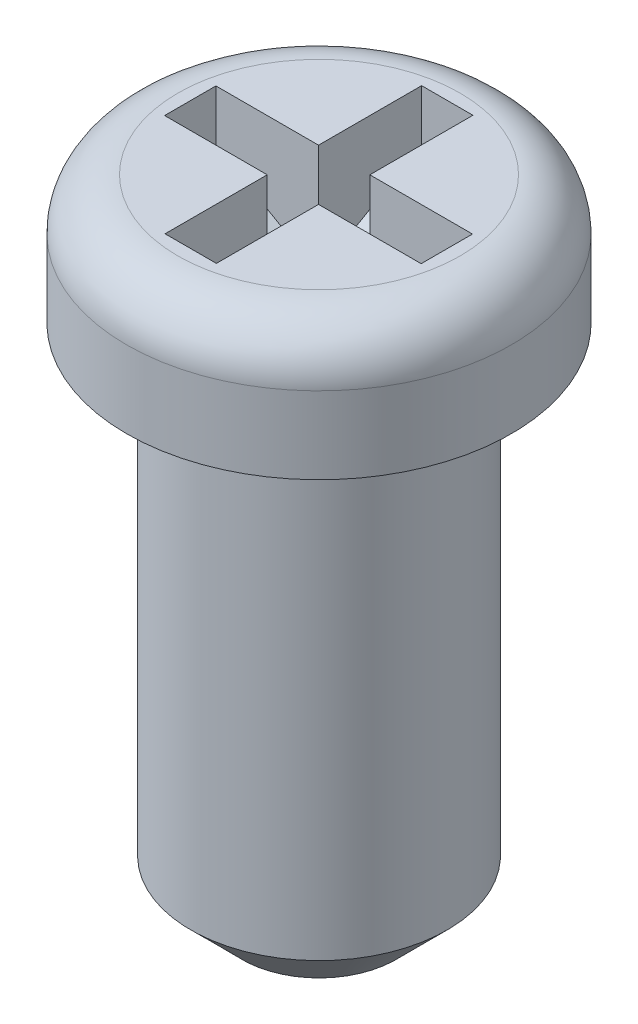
from build123d import *
from OCP.BRepFilletAPI import BRepFilletAPI_MakeChamfer

# Parameters (mm, degrees)
ENL_V_MAT_EXTRU_1_DEPTH = 0.8
CHANFREIN1_SIZE         = 0.4
CHANFREIN1_SIZE2        = 0.692820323


with BuildPart() as part:
    # Esquisse1 → R_volution1 (revolve)
    with BuildSketch(Plane.XY, mode=Mode.PRIVATE) as r_volution1_sk:
        with BuildLine():
            Line((1.5, -0.4), (1.5, -1))
            Line((1.5, -1), (1, -1))
            Line((1, -1), (1, -4.6))
            Line((1, -4.6), (0.6, -5))
            Line((0.6, -5), (0, -5))
            Line((0, -5), (0, 0))
            Line((0, 0), (1.1, 0))
            ThreePointArc((1.1, 0), (1.382842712, -0.117157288), (1.5, -0.4))
        make_face()
    revolve(r_volution1_sk.sketch.rotate(Axis((0, -5, 0), (0, 1, 0)), 90), axis=Axis((0, -5, 0), (0, 1, 0)))

    # Esquisse2 → Enl_v. mat.-Extru.1 (cut)
    with BuildSketch(Plane(origin=(0, 0, 0), x_dir=(1, 0, 0), z_dir=(0, 1, 0))):
        Polygon((-0.2, -0.203580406), (-0.2, -1), (0.2, -1), (0.2, -0.203580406), (1, -0.203580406), (1, 0.196419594), (0.2, 0.196419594), (0.2, 1), (-0.2, 1), (-0.2, 0.196419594), (-1, 0.196419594), (-1, -0.203580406), align=None)
    extrude(amount=-ENL_V_MAT_EXTRU_1_DEPTH, mode=Mode.SUBTRACT)

    # Chanfrein1: one chamfer whose edges measure the first distance from different faces: ONE call of the kernel's chamfer builder (chamfer() names one face for all edges)
    chanfrein1_edges_1 = [part.edges().sort_by_distance(p)[0] for p in [
        (-1, -0.8, 0.003580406),
    ]]
    chanfrein1_side_1 = [part.faces().sort_by_distance(p)[0] for p in [
        (-1, -0.4, 0.003580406),
    ]]
    chanfrein1_edges_2 = [part.edges().sort_by_distance(p)[0] for p in [
        (0, -0.8, -1),
    ]]
    chanfrein1_side_2 = [part.faces().sort_by_distance(p)[0] for p in [
        (0, -0.4, -1),
    ]]
    chanfrein1_edges_3 = [part.edges().sort_by_distance(p)[0] for p in [
        (1, -0.8, 0.003580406),
    ]]
    chanfrein1_side_3 = [part.faces().sort_by_distance(p)[0] for p in [
        (1, -0.4, 0.003580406),
    ]]
    chanfrein1_edges_4 = [part.edges().sort_by_distance(p)[0] for p in [
        (0, -0.8, 1),
    ]]
    chanfrein1_side_4 = [part.faces().sort_by_distance(p)[0] for p in [
        (0, -0.4, 1),
    ]]
    chanfrein1 = BRepFilletAPI_MakeChamfer(part.part.solid().wrapped)
    for e in chanfrein1_edges_1:
        chanfrein1.Add(CHANFREIN1_SIZE, CHANFREIN1_SIZE2, e.wrapped, chanfrein1_side_1[0].wrapped)  # the first distance lies on this face
    for e in chanfrein1_edges_2:
        chanfrein1.Add(CHANFREIN1_SIZE, CHANFREIN1_SIZE2, e.wrapped, chanfrein1_side_2[0].wrapped)  # the first distance lies on this face
    for e in chanfrein1_edges_3:
        chanfrein1.Add(CHANFREIN1_SIZE, CHANFREIN1_SIZE2, e.wrapped, chanfrein1_side_3[0].wrapped)  # the first distance lies on this face
    for e in chanfrein1_edges_4:
        chanfrein1.Add(CHANFREIN1_SIZE, CHANFREIN1_SIZE2, e.wrapped, chanfrein1_side_4[0].wrapped)  # the first distance lies on this face
    add(Compound.cast(chanfrein1.Shape()), mode=Mode.REPLACE)


solid = part.part
